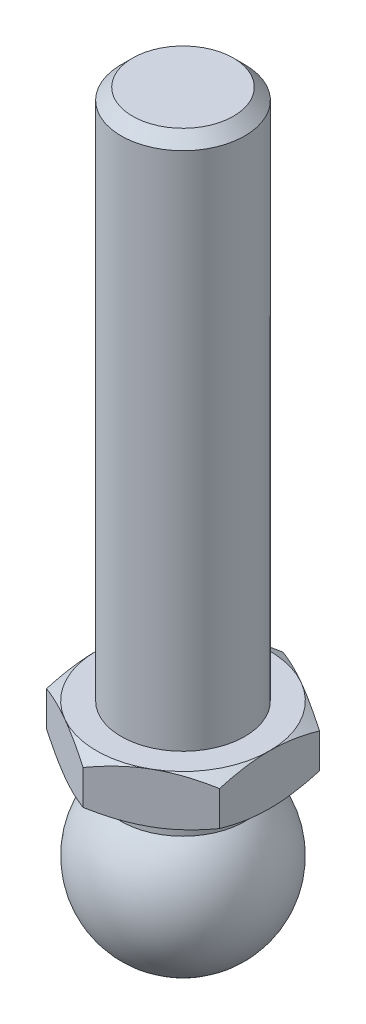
ISO-10303-21;
HEADER;
FILE_DESCRIPTION(('STEP AP214'),'2;1');
FILE_NAME('part.step','',(''),(''),'','','');
FILE_SCHEMA(('AUTOMOTIVE_DESIGN { 1 0 10303 214 1 1 1 1 }'));
ENDSEC;
DATA;
#1=APPLICATION_CONTEXT('core data for automotive mechanical design processes');
#2=APPLICATION_PROTOCOL_DEFINITION('international standard','automotive_design',2000,#1);
#3=PRODUCT_CONTEXT('',#1,'mechanical');
#4=PRODUCT('Part','Part','',(#3));
#5=PRODUCT_RELATED_PRODUCT_CATEGORY('part','',(#4));
#6=PRODUCT_DEFINITION_FORMATION('','',#4);
#7=PRODUCT_DEFINITION_CONTEXT('part definition',#1,'design');
#8=PRODUCT_DEFINITION('design','',#6,#7);
#9=PRODUCT_DEFINITION_SHAPE('','',#8);
#10=(LENGTH_UNIT() NAMED_UNIT(*) SI_UNIT(.MILLI.,.METRE.));
#11=(NAMED_UNIT(*) PLANE_ANGLE_UNIT() SI_UNIT($,.RADIAN.));
#12=(NAMED_UNIT(*) SI_UNIT($,.STERADIAN.) SOLID_ANGLE_UNIT());
#13=UNCERTAINTY_MEASURE_WITH_UNIT(LENGTH_MEASURE(1.E-05),#10,'distance_accuracy_value','');
#14=(GEOMETRIC_REPRESENTATION_CONTEXT(3) GLOBAL_UNCERTAINTY_ASSIGNED_CONTEXT((#13)) GLOBAL_UNIT_ASSIGNED_CONTEXT((#10,
#11,#12)) REPRESENTATION_CONTEXT('',''));
#15=CARTESIAN_POINT('',(0.,0.,0.));
#16=DIRECTION('',(0.,0.,1.));
#17=DIRECTION('',(1.,0.,0.));
#18=AXIS2_PLACEMENT_3D('',#15,#16,#17);
#19=CARTESIAN_POINT('',(0.,10.85,0.));
#20=DIRECTION('',(0.,-1.,0.));
#21=DIRECTION('',(0.,0.,-1.));
#22=AXIS2_PLACEMENT_3D('',#19,#20,#21);
#23=CONICAL_SURFACE('',#22,7.,1.0471975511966);
#24=CARTESIAN_POINT('',(-7.,6.7882826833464,12.1648696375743));
#25=CARTESIAN_POINT('',(-7.,6.93391573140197,11.8738003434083));
#26=CARTESIAN_POINT('',(-7.,7.07854589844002,11.5822239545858));
#27=CARTESIAN_POINT('',(-7.,7.36531569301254,10.997825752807));
#28=CARTESIAN_POINT('',(-7.,7.50745515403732,10.7050038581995));
#29=CARTESIAN_POINT('',(-7.,7.78902214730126,10.117331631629));
#30=CARTESIAN_POINT('',(-7.,7.92844364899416,9.82247840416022));
#31=CARTESIAN_POINT('',(-7.,8.20360604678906,9.23106328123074));
#32=CARTESIAN_POINT('',(-7.,8.33934701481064,8.93450141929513));
#33=CARTESIAN_POINT('',(-7.,8.61231104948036,8.32593520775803));
#34=CARTESIAN_POINT('',(-7.,8.74932547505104,8.01383696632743));
#35=CARTESIAN_POINT('',(-7.,9.01713837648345,7.38695797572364));
#36=CARTESIAN_POINT('',(-7.,9.14793657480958,7.07217710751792));
#37=CARTESIAN_POINT('',(-7.,9.4015530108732,6.4396244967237));
#38=CARTESIAN_POINT('',(-7.,9.52437615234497,6.12185473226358));
#39=CARTESIAN_POINT('',(-7.,9.75990162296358,5.48260317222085));
#40=CARTESIAN_POINT('',(-7.,9.87260505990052,5.16112178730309));
#41=CARTESIAN_POINT('',(-7.,10.1099014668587,4.43821731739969));
#42=CARTESIAN_POINT('',(-7.,10.2311181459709,4.03566892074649));
#43=CARTESIAN_POINT('',(-7.,10.4469740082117,3.22331060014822));
#44=CARTESIAN_POINT('',(-7.,10.5416155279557,2.81350131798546));
#45=CARTESIAN_POINT('',(-7.,10.6569999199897,2.19742561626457));
#46=CARTESIAN_POINT('',(-7.,10.6908518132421,1.99359214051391));
#47=CARTESIAN_POINT('',(-7.,10.7493191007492,1.58461613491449));
#48=CARTESIAN_POINT('',(-7.,10.7739358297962,1.37947379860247));
#49=CARTESIAN_POINT('',(-7.,10.8131968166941,0.96828958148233));
#50=CARTESIAN_POINT('',(-7.,10.8278439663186,0.762247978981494));
#51=CARTESIAN_POINT('',(-7.,10.8467021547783,0.349683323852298));
#52=CARTESIAN_POINT('',(-7.,10.8509132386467,0.143160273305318));
#53=CARTESIAN_POINT('',(-7.,10.8487493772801,-0.271082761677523));
#54=CARTESIAN_POINT('',(-7.,10.8423100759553,-0.478802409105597));
#55=CARTESIAN_POINT('',(-7.,10.8189433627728,-0.893645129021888));
#56=CARTESIAN_POINT('',(-7.,10.8020159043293,-1.10076819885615));
#57=CARTESIAN_POINT('',(-7.,10.7582124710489,-1.514030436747));
#58=CARTESIAN_POINT('',(-7.,10.7313327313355,-1.72016920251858));
#59=CARTESIAN_POINT('',(-7.,10.6684180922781,-2.13103319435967));
#60=CARTESIAN_POINT('',(-7.,10.6323828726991,-2.33575837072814));
#61=CARTESIAN_POINT('',(-7.,10.5105686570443,-2.95437912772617));
#62=CARTESIAN_POINT('',(-7.,10.4118729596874,-3.36575077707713));
#63=CARTESIAN_POINT('',(-7.,10.1884533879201,-4.18138012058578));
#64=CARTESIAN_POINT('',(-7.,10.0637148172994,-4.58563365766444));
#65=CARTESIAN_POINT('',(-7.,9.82332483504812,-5.30320893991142));
#66=CARTESIAN_POINT('',(-7.,9.71128759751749,-5.617759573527));
#67=CARTESIAN_POINT('',(-7.,9.47785144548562,-6.24325021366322));
#68=CARTESIAN_POINT('',(-7.,9.35645511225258,-6.55419118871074));
#69=CARTESIAN_POINT('',(-7.,9.10620704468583,-7.17328528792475));
#70=CARTESIAN_POINT('',(-7.,8.97735033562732,-7.48143638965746));
#71=CARTESIAN_POINT('',(-7.,8.71378231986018,-8.09523802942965));
#72=CARTESIAN_POINT('',(-7.,8.57907065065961,-8.40088841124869));
#73=CARTESIAN_POINT('',(-7.,8.31078407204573,-8.99716345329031));
#74=CARTESIAN_POINT('',(-7.,8.17740317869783,-9.28787568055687));
#75=CARTESIAN_POINT('',(-7.,7.90714715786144,-9.86766295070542));
#76=CARTESIAN_POINT('',(-7.,7.77027208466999,-10.1567380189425));
#77=CARTESIAN_POINT('',(-7.,7.49389786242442,-10.7329937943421));
#78=CARTESIAN_POINT('',(-7.,7.35440383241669,-11.0201769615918));
#79=CARTESIAN_POINT('',(-7.,7.07302286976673,-11.5933594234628));
#80=CARTESIAN_POINT('',(-7.,6.93113600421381,-11.879358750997));
#81=CARTESIAN_POINT('',(-7.,6.7882826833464,-12.1648696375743));
#82=B_SPLINE_CURVE_WITH_KNOTS('',3,(#24,#25,#26,#27,#28,#29,#30,#31,#32,#33,#34,#35,#36,#37,#38,
#39,#40,#41,#42,#43,#44,#45,#46,#47,#48,#49,#50,#51,#52,#53,#54,#55,#56,#57,#58,#59,#60,#61,#62,
#63,#64,#65,#66,#67,#68,#69,#70,#71,#72,#73,#74,#75,#76,#77,#78,#79,#80,#81),.UNSPECIFIED.,.F.,
.F.,(4,2,2,2,2,2,2,2,2,2,2,2,2,2,2,2,2,2,2,2,2,2,2,2,2,2,2,2,4),(0.,0.976413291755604,
1.95289161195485,2.93133423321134,3.90975772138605,4.93225217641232,5.95479223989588,
6.97669748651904,7.99849072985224,9.25906449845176,10.5195273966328,11.1392271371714,
11.7588372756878,12.3782676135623,12.9976952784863,13.6208795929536,14.2440666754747,
14.8674897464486,15.4909346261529,16.7587972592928,18.0273773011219,19.0289263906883,
20.0302002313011,21.0321496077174,22.0341611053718,22.9936838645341,23.9531917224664,
24.9109871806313,25.8687558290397),.UNSPECIFIED.);
#83=CARTESIAN_POINT('',(-7.,10.2247852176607,4.04145188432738));
#84=VERTEX_POINT('',#83);
#85=CARTESIAN_POINT('',(-7.,10.85,0.));
#86=VERTEX_POINT('',#85);
#87=EDGE_CURVE('E309',#84,#86,#82,.T.);
#88=ORIENTED_EDGE('',*,*,#87,.F.);
#89=CARTESIAN_POINT('',(0.00020000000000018,10.2247185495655,8.0830192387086));
#90=CARTESIAN_POINT('',(-0.153667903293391,10.2760001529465,7.99418356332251));
#91=CARTESIAN_POINT('',(-0.30810950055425,10.3249544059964,7.90501666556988));
#92=CARTESIAN_POINT('',(-0.618246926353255,10.4175672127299,7.72595873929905));
#93=CARTESIAN_POINT('',(-0.773943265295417,10.4612234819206,7.63606741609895));
#94=CARTESIAN_POINT('',(-1.24352516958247,10.5833884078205,7.36495417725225));
#95=CARTESIAN_POINT('',(-1.5592643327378,10.652874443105,7.18266208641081));
#96=CARTESIAN_POINT('',(-2.03176224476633,10.7343550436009,6.9098652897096));
#97=CARTESIAN_POINT('',(-2.18710922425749,10.7575665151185,6.82017566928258));
#98=CARTESIAN_POINT('',(-2.49850511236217,10.7964887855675,6.64039116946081));
#99=CARTESIAN_POINT('',(-2.65455395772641,10.8122002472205,6.55029632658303));
#100=CARTESIAN_POINT('',(-2.96692267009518,10.8357220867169,6.3699501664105));
#101=CARTESIAN_POINT('',(-3.12324202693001,10.8435414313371,6.27969914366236));
#102=CARTESIAN_POINT('',(-3.43601650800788,10.8511197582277,6.09911871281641));
#103=CARTESIAN_POINT('',(-3.59247162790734,10.850878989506,6.00878930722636));
#104=CARTESIAN_POINT('',(-4.02110687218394,10.8391402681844,5.76131663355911));
#105=CARTESIAN_POINT('',(-4.2931466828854,10.8194342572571,5.60425437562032));
#106=CARTESIAN_POINT('',(-4.8354194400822,10.7569465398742,5.29117305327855));
#107=CARTESIAN_POINT('',(-5.10565047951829,10.714143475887,5.13515508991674));
#108=CARTESIAN_POINT('',(-5.64901454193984,10.6071483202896,4.82144370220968));
#109=CARTESIAN_POINT('',(-5.92207900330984,10.5425029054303,4.66378986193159));
#110=CARTESIAN_POINT('',(-6.46413578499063,10.395783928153,4.35083323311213));
#111=CARTESIAN_POINT('',(-6.73313504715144,10.3137448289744,4.19552643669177));
#112=CARTESIAN_POINT('',(-7.0002,10.2247185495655,4.04133641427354));
#113=B_SPLINE_CURVE_WITH_KNOTS('',3,(#89,#90,#91,#92,#93,#94,#95,#96,#97,#98,#99,#100,#101,#102,
#103,#104,#105,#106,#107,#108,#109,#110,#111,#112),.UNSPECIFIED.,.F.,.F.,(4,2,2,2,2,2,2,2,2,2,2,
4),(0.,0.554727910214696,1.10969417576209,2.2219327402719,2.76443041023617,3.30688013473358,
3.84871284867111,4.3905288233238,5.33376515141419,6.27787517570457,7.2429241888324,
8.20607866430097),.UNSPECIFIED.);
#114=CARTESIAN_POINT('',(-3.5,10.85,6.06217782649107));
#115=VERTEX_POINT('',#114);
#116=EDGE_CURVE('E135',#115,#84,#113,.T.);
#117=ORIENTED_EDGE('',*,*,#116,.F.);
#118=CARTESIAN_POINT('',(0.,10.85,0.));
#119=DIRECTION('',(0.,-1.,0.));
#120=DIRECTION('',(0.,0.,-1.));
#121=AXIS2_PLACEMENT_3D('',#118,#119,#120);
#122=CIRCLE('',#121,7.);
#123=EDGE_CURVE('E283',#115,#86,#122,.T.);
#124=ORIENTED_EDGE('',*,*,#123,.T.);
#125=EDGE_LOOP('',(#88,#117,#124));
#126=FACE_BOUND('',#125,.T.);
#127=ADVANCED_FACE('F14',(#126),#23,.T.);
#128=CARTESIAN_POINT('',(-7.,10.2247852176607,-4.04145188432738));
#129=VERTEX_POINT('',#128);
#130=EDGE_CURVE('E193',#86,#129,#82,.T.);
#131=ORIENTED_EDGE('',*,*,#130,.F.);
#132=CARTESIAN_POINT('',(-3.5,10.85,-6.06217782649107));
#133=VERTEX_POINT('',#132);
#134=EDGE_CURVE('E195',#86,#133,#122,.T.);
#135=ORIENTED_EDGE('',*,*,#134,.T.);
#136=CARTESIAN_POINT('',(-7.0002,10.2247185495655,-4.04133641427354));
#137=CARTESIAN_POINT('',(-6.84633209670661,10.2760001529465,-4.13017208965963));
#138=CARTESIAN_POINT('',(-6.69189049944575,10.3249544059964,-4.21933898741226));
#139=CARTESIAN_POINT('',(-6.38175307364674,10.4175672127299,-4.39839691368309));
#140=CARTESIAN_POINT('',(-6.22605673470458,10.4612234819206,-4.48828823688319));
#141=CARTESIAN_POINT('',(-5.75647483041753,10.5833884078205,-4.75940147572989));
#142=CARTESIAN_POINT('',(-5.44073566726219,10.652874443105,-4.94169356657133));
#143=CARTESIAN_POINT('',(-4.96823775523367,10.7343550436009,-5.21449036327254));
#144=CARTESIAN_POINT('',(-4.81289077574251,10.7575665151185,-5.30417998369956));
#145=CARTESIAN_POINT('',(-4.50149488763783,10.7964887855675,-5.48396448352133));
#146=CARTESIAN_POINT('',(-4.34544604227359,10.8122002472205,-5.57405932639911));
#147=CARTESIAN_POINT('',(-4.03307732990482,10.8357220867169,-5.75440548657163));
#148=CARTESIAN_POINT('',(-3.87675797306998,10.8435414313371,-5.84465650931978));
#149=CARTESIAN_POINT('',(-3.56398349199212,10.8511197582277,-6.02523694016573));
#150=CARTESIAN_POINT('',(-3.40752837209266,10.850878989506,-6.11556634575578));
#151=CARTESIAN_POINT('',(-2.97889312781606,10.8391402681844,-6.36303901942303));
#152=CARTESIAN_POINT('',(-2.70685331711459,10.8194342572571,-6.52010127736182));
#153=CARTESIAN_POINT('',(-2.1645805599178,10.7569465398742,-6.83318259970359));
#154=CARTESIAN_POINT('',(-1.89434952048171,10.714143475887,-6.9892005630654));
#155=CARTESIAN_POINT('',(-1.35098545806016,10.6071483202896,-7.30291195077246));
#156=CARTESIAN_POINT('',(-1.07792099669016,10.5425029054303,-7.46056579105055));
#157=CARTESIAN_POINT('',(-0.535864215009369,10.395783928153,-7.77352241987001));
#158=CARTESIAN_POINT('',(-0.266864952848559,10.3137448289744,-7.92882921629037));
#159=CARTESIAN_POINT('',(0.000200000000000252,10.2247185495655,-8.0830192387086));
#160=B_SPLINE_CURVE_WITH_KNOTS('',3,(#136,#137,#138,#139,#140,#141,#142,#143,#144,#145,#146,
#147,#148,#149,#150,#151,#152,#153,#154,#155,#156,#157,#158,#159),.UNSPECIFIED.,.F.,.F.,(4,2,2,
2,2,2,2,2,2,2,2,4),(0.,0.554727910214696,1.10969417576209,2.2219327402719,2.76443041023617,
3.30688013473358,3.8487128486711,4.3905288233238,5.33376515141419,6.27787517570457,
7.2429241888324,8.20607866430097),.UNSPECIFIED.);
#161=EDGE_CURVE('E183',#129,#133,#160,.T.);
#162=ORIENTED_EDGE('',*,*,#161,.F.);
#163=EDGE_LOOP('',(#131,#135,#162));
#164=FACE_BOUND('',#163,.T.);
#165=ADVANCED_FACE('F192',(#164),#23,.T.);
#166=CARTESIAN_POINT('',(0.,10.2247852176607,-8.08290376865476));
#167=VERTEX_POINT('',#166);
#168=EDGE_CURVE('E197',#133,#167,#160,.T.);
#169=ORIENTED_EDGE('',*,*,#168,.F.);
#170=CARTESIAN_POINT('',(3.5,10.85,-6.06217782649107));
#171=VERTEX_POINT('',#170);
#172=EDGE_CURVE('E293',#133,#171,#122,.T.);
#173=ORIENTED_EDGE('',*,*,#172,.T.);
#174=CARTESIAN_POINT('',(-0.00020000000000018,10.2247185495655,-8.0830192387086));
#175=CARTESIAN_POINT('',(0.153667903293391,10.2760001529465,-7.99418356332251));
#176=CARTESIAN_POINT('',(0.30810950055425,10.3249544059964,-7.90501666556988));
#177=CARTESIAN_POINT('',(0.618246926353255,10.4175672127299,-7.72595873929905));
#178=CARTESIAN_POINT('',(0.773943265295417,10.4612234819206,-7.63606741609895));
#179=CARTESIAN_POINT('',(1.24352516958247,10.5833884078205,-7.36495417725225));
#180=CARTESIAN_POINT('',(1.5592643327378,10.652874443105,-7.18266208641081));
#181=CARTESIAN_POINT('',(2.03176224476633,10.7343550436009,-6.9098652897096));
#182=CARTESIAN_POINT('',(2.18710922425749,10.7575665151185,-6.82017566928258));
#183=CARTESIAN_POINT('',(2.49850511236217,10.7964887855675,-6.64039116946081));
#184=CARTESIAN_POINT('',(2.65455395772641,10.8122002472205,-6.55029632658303));
#185=CARTESIAN_POINT('',(2.96692267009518,10.8357220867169,-6.3699501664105));
#186=CARTESIAN_POINT('',(3.12324202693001,10.8435414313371,-6.27969914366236));
#187=CARTESIAN_POINT('',(3.43601650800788,10.8511197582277,-6.09911871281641));
#188=CARTESIAN_POINT('',(3.59247162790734,10.850878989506,-6.00878930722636));
#189=CARTESIAN_POINT('',(4.02110687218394,10.8391402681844,-5.76131663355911));
#190=CARTESIAN_POINT('',(4.2931466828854,10.8194342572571,-5.60425437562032));
#191=CARTESIAN_POINT('',(4.8354194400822,10.7569465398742,-5.29117305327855));
#192=CARTESIAN_POINT('',(5.10565047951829,10.714143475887,-5.13515508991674));
#193=CARTESIAN_POINT('',(5.64901454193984,10.6071483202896,-4.82144370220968));
#194=CARTESIAN_POINT('',(5.92207900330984,10.5425029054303,-4.66378986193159));
#195=CARTESIAN_POINT('',(6.46413578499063,10.395783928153,-4.35083323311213));
#196=CARTESIAN_POINT('',(6.73313504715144,10.3137448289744,-4.19552643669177));
#197=CARTESIAN_POINT('',(7.0002,10.2247185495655,-4.04133641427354));
#198=B_SPLINE_CURVE_WITH_KNOTS('',3,(#174,#175,#176,#177,#178,#179,#180,#181,#182,#183,#184,
#185,#186,#187,#188,#189,#190,#191,#192,#193,#194,#195,#196,#197),.UNSPECIFIED.,.F.,.F.,(4,2,2,
2,2,2,2,2,2,2,2,4),(0.,0.554727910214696,1.10969417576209,2.2219327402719,2.76443041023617,
3.30688013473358,3.84871284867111,4.3905288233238,5.33376515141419,6.27787517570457,
7.2429241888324,8.20607866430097),.UNSPECIFIED.);
#199=EDGE_CURVE('E243',#167,#171,#198,.T.);
#200=ORIENTED_EDGE('',*,*,#199,.F.);
#201=EDGE_LOOP('',(#169,#173,#200));
#202=FACE_BOUND('',#201,.T.);
#203=ADVANCED_FACE('F342',(#202),#23,.T.);
#204=CARTESIAN_POINT('',(7.,10.2247852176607,-4.04145188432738));
#205=VERTEX_POINT('',#204);
#206=EDGE_CURVE('E238',#171,#205,#198,.T.);
#207=ORIENTED_EDGE('',*,*,#206,.F.);
#208=CARTESIAN_POINT('',(7.,10.85,0.));
#209=VERTEX_POINT('',#208);
#210=EDGE_CURVE('E288',#171,#209,#122,.T.);
#211=ORIENTED_EDGE('',*,*,#210,.T.);
#212=CARTESIAN_POINT('',(7.,6.7882826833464,-12.1648696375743));
#213=CARTESIAN_POINT('',(7.,6.93391573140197,-11.8738003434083));
#214=CARTESIAN_POINT('',(7.,7.07854589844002,-11.5822239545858));
#215=CARTESIAN_POINT('',(7.,7.36531569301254,-10.997825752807));
#216=CARTESIAN_POINT('',(7.,7.50745515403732,-10.7050038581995));
#217=CARTESIAN_POINT('',(7.,7.78902214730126,-10.117331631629));
#218=CARTESIAN_POINT('',(7.,7.92844364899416,-9.82247840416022));
#219=CARTESIAN_POINT('',(7.,8.20360604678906,-9.23106328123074));
#220=CARTESIAN_POINT('',(7.,8.33934701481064,-8.93450141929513));
#221=CARTESIAN_POINT('',(7.,8.61231104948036,-8.32593520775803));
#222=CARTESIAN_POINT('',(7.,8.74932547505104,-8.01383696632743));
#223=CARTESIAN_POINT('',(7.,9.01713837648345,-7.38695797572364));
#224=CARTESIAN_POINT('',(7.,9.14793657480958,-7.07217710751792));
#225=CARTESIAN_POINT('',(7.,9.4015530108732,-6.4396244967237));
#226=CARTESIAN_POINT('',(7.,9.52437615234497,-6.12185473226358));
#227=CARTESIAN_POINT('',(7.,9.75990162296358,-5.48260317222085));
#228=CARTESIAN_POINT('',(7.,9.87260505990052,-5.16112178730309));
#229=CARTESIAN_POINT('',(7.,10.1099014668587,-4.43821731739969));
#230=CARTESIAN_POINT('',(7.,10.2311181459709,-4.03566892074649));
#231=CARTESIAN_POINT('',(7.,10.4469740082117,-3.22331060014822));
#232=CARTESIAN_POINT('',(7.,10.5416155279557,-2.81350131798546));
#233=CARTESIAN_POINT('',(7.,10.6569999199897,-2.19742561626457));
#234=CARTESIAN_POINT('',(7.,10.6908518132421,-1.99359214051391));
#235=CARTESIAN_POINT('',(7.,10.7493191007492,-1.58461613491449));
#236=CARTESIAN_POINT('',(7.,10.7739358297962,-1.37947379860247));
#237=CARTESIAN_POINT('',(7.,10.8131968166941,-0.96828958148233));
#238=CARTESIAN_POINT('',(7.,10.8278439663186,-0.762247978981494));
#239=CARTESIAN_POINT('',(7.,10.8467021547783,-0.349683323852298));
#240=CARTESIAN_POINT('',(7.,10.8509132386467,-0.143160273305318));
#241=CARTESIAN_POINT('',(7.,10.8487493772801,0.271082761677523));
#242=CARTESIAN_POINT('',(7.,10.8423100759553,0.478802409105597));
#243=CARTESIAN_POINT('',(7.,10.8189433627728,0.893645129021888));
#244=CARTESIAN_POINT('',(7.,10.8020159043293,1.10076819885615));
#245=CARTESIAN_POINT('',(7.,10.7582124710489,1.514030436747));
#246=CARTESIAN_POINT('',(7.,10.7313327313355,1.72016920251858));
#247=CARTESIAN_POINT('',(7.,10.6684180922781,2.13103319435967));
#248=CARTESIAN_POINT('',(7.,10.6323828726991,2.33575837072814));
#249=CARTESIAN_POINT('',(7.,10.5105686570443,2.95437912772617));
#250=CARTESIAN_POINT('',(7.,10.4118729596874,3.36575077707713));
#251=CARTESIAN_POINT('',(7.,10.1884533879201,4.18138012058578));
#252=CARTESIAN_POINT('',(7.,10.0637148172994,4.58563365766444));
#253=CARTESIAN_POINT('',(7.,9.82332483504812,5.30320893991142));
#254=CARTESIAN_POINT('',(7.,9.71128759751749,5.617759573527));
#255=CARTESIAN_POINT('',(7.,9.47785144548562,6.24325021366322));
#256=CARTESIAN_POINT('',(7.,9.35645511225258,6.55419118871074));
#257=CARTESIAN_POINT('',(7.,9.10620704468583,7.17328528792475));
#258=CARTESIAN_POINT('',(7.,8.97735033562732,7.48143638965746));
#259=CARTESIAN_POINT('',(7.,8.71378231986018,8.09523802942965));
#260=CARTESIAN_POINT('',(7.,8.57907065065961,8.40088841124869));
#261=CARTESIAN_POINT('',(7.,8.31078407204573,8.99716345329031));
#262=CARTESIAN_POINT('',(7.,8.17740317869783,9.28787568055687));
#263=CARTESIAN_POINT('',(7.,7.90714715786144,9.86766295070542));
#264=CARTESIAN_POINT('',(7.,7.77027208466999,10.1567380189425));
#265=CARTESIAN_POINT('',(7.,7.49389786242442,10.7329937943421));
#266=CARTESIAN_POINT('',(7.,7.35440383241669,11.0201769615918));
#267=CARTESIAN_POINT('',(7.,7.07302286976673,11.5933594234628));
#268=CARTESIAN_POINT('',(7.,6.93113600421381,11.879358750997));
#269=CARTESIAN_POINT('',(7.,6.7882826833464,12.1648696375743));
#270=B_SPLINE_CURVE_WITH_KNOTS('',3,(#212,#213,#214,#215,#216,#217,#218,#219,#220,#221,#222,
#223,#224,#225,#226,#227,#228,#229,#230,#231,#232,#233,#234,#235,#236,#237,#238,#239,#240,#241,
#242,#243,#244,#245,#246,#247,#248,#249,#250,#251,#252,#253,#254,#255,#256,#257,#258,#259,#260,
#261,#262,#263,#264,#265,#266,#267,#268,#269),.UNSPECIFIED.,.F.,.F.,(4,2,2,2,2,2,2,2,2,2,2,2,2,
2,2,2,2,2,2,2,2,2,2,2,2,2,2,2,4),(0.,0.976413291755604,1.95289161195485,2.93133423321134,
3.90975772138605,4.93225217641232,5.95479223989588,6.97669748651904,7.99849072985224,
9.25906449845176,10.5195273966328,11.1392271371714,11.7588372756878,12.3782676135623,
12.9976952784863,13.6208795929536,14.2440666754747,14.8674897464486,15.4909346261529,
16.7587972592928,18.0273773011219,19.0289263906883,20.0302002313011,21.0321496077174,
22.0341611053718,22.9936838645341,23.9531917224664,24.9109871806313,25.8687558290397),.UNSPECIFIED.);
#271=EDGE_CURVE('E249',#205,#209,#270,.T.);
#272=ORIENTED_EDGE('',*,*,#271,.F.);
#273=EDGE_LOOP('',(#207,#211,#272));
#274=FACE_BOUND('',#273,.T.);
#275=ADVANCED_FACE('F352',(#274),#23,.T.);
#276=CARTESIAN_POINT('',(7.,10.2247852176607,4.04145188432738));
#277=VERTEX_POINT('',#276);
#278=EDGE_CURVE('E251',#209,#277,#270,.T.);
#279=ORIENTED_EDGE('',*,*,#278,.F.);
#280=CARTESIAN_POINT('',(3.5,10.85,6.06217782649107));
#281=VERTEX_POINT('',#280);
#282=EDGE_CURVE('E281',#209,#281,#122,.T.);
#283=ORIENTED_EDGE('',*,*,#282,.T.);
#284=CARTESIAN_POINT('',(7.0002,10.2247185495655,4.04133641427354));
#285=CARTESIAN_POINT('',(6.84633209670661,10.2760001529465,4.13017208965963));
#286=CARTESIAN_POINT('',(6.69189049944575,10.3249544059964,4.21933898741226));
#287=CARTESIAN_POINT('',(6.38175307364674,10.4175672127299,4.39839691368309));
#288=CARTESIAN_POINT('',(6.22605673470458,10.4612234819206,4.48828823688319));
#289=CARTESIAN_POINT('',(5.75647483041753,10.5833884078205,4.75940147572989));
#290=CARTESIAN_POINT('',(5.44073566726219,10.652874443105,4.94169356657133));
#291=CARTESIAN_POINT('',(4.96823775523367,10.7343550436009,5.21449036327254));
#292=CARTESIAN_POINT('',(4.81289077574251,10.7575665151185,5.30417998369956));
#293=CARTESIAN_POINT('',(4.50149488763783,10.7964887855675,5.48396448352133));
#294=CARTESIAN_POINT('',(4.34544604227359,10.8122002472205,5.57405932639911));
#295=CARTESIAN_POINT('',(4.03307732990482,10.8357220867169,5.75440548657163));
#296=CARTESIAN_POINT('',(3.87675797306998,10.8435414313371,5.84465650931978));
#297=CARTESIAN_POINT('',(3.56398349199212,10.8511197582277,6.02523694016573));
#298=CARTESIAN_POINT('',(3.40752837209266,10.850878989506,6.11556634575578));
#299=CARTESIAN_POINT('',(2.97889312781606,10.8391402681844,6.36303901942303));
#300=CARTESIAN_POINT('',(2.70685331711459,10.8194342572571,6.52010127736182));
#301=CARTESIAN_POINT('',(2.1645805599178,10.7569465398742,6.83318259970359));
#302=CARTESIAN_POINT('',(1.89434952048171,10.714143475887,6.9892005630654));
#303=CARTESIAN_POINT('',(1.35098545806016,10.6071483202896,7.30291195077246));
#304=CARTESIAN_POINT('',(1.07792099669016,10.5425029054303,7.46056579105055));
#305=CARTESIAN_POINT('',(0.535864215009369,10.395783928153,7.77352241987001));
#306=CARTESIAN_POINT('',(0.266864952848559,10.3137448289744,7.92882921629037));
#307=CARTESIAN_POINT('',(-0.000200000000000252,10.2247185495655,8.0830192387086));
#308=B_SPLINE_CURVE_WITH_KNOTS('',3,(#284,#285,#286,#287,#288,#289,#290,#291,#292,#293,#294,
#295,#296,#297,#298,#299,#300,#301,#302,#303,#304,#305,#306,#307),.UNSPECIFIED.,.F.,.F.,(4,2,2,
2,2,2,2,2,2,2,2,4),(0.,0.554727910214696,1.10969417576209,2.2219327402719,2.76443041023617,
3.30688013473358,3.8487128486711,4.3905288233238,5.33376515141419,6.27787517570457,
7.2429241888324,8.20607866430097),.UNSPECIFIED.);
#309=EDGE_CURVE('E126',#277,#281,#308,.T.);
#310=ORIENTED_EDGE('',*,*,#309,.F.);
#311=EDGE_LOOP('',(#279,#283,#310));
#312=FACE_BOUND('',#311,.T.);
#313=ADVANCED_FACE('F285',(#312),#23,.T.);
#314=CARTESIAN_POINT('',(0.,10.2247852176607,8.08290376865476));
#315=VERTEX_POINT('',#314);
#316=EDGE_CURVE('E116',#281,#315,#308,.T.);
#317=ORIENTED_EDGE('',*,*,#316,.F.);
#318=EDGE_CURVE('E274',#281,#115,#122,.T.);
#319=ORIENTED_EDGE('',*,*,#318,.T.);
#320=EDGE_CURVE('E29',#315,#115,#113,.T.);
#321=ORIENTED_EDGE('',*,*,#320,.F.);
#322=EDGE_LOOP('',(#317,#319,#321));
#323=FACE_BOUND('',#322,.T.);
#324=ADVANCED_FACE('F273',(#323),#23,.T.);
#325=CARTESIAN_POINT('',(0.,53.85,0.));
#326=DIRECTION('',(0.,-1.,0.));
#327=DIRECTION('',(0.,0.,-1.));
#328=AXIS2_PLACEMENT_3D('',#325,#326,#327);
#329=PLANE('',#328);
#330=CARTESIAN_POINT('',(0.,53.85,0.));
#331=DIRECTION('',(0.,-1.,0.));
#332=DIRECTION('',(0.,0.,-1.));
#333=AXIS2_PLACEMENT_3D('',#330,#331,#332);
#334=CIRCLE('',#333,4.08);
#335=CARTESIAN_POINT('',(0.,53.85,-4.08));
#336=VERTEX_POINT('',#335);
#337=EDGE_CURVE('E22',#336,#336,#334,.T.);
#338=ORIENTED_EDGE('',*,*,#337,.F.);
#339=EDGE_LOOP('',(#338));
#340=FACE_BOUND('',#339,.T.);
#341=ADVANCED_FACE('F16',(#340),#329,.F.);
#342=CARTESIAN_POINT('',(0.,53.85,0.));
#343=DIRECTION('',(0.,-1.,0.));
#344=DIRECTION('',(0.,0.,-1.));
#345=AXIS2_PLACEMENT_3D('',#342,#343,#344);
#346=CONICAL_SURFACE('',#345,4.08,0.785398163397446);
#347=CARTESIAN_POINT('',(0.,52.93,0.));
#348=DIRECTION('',(0.,-1.,0.));
#349=DIRECTION('',(0.,0.,-1.));
#350=AXIS2_PLACEMENT_3D('',#347,#348,#349);
#351=CIRCLE('',#350,5.);
#352=CARTESIAN_POINT('',(0.,52.93,-5.));
#353=VERTEX_POINT('',#352);
#354=EDGE_CURVE('E290',#353,#353,#351,.T.);
#355=ORIENTED_EDGE('',*,*,#354,.F.);
#356=EDGE_LOOP('',(#355));
#357=FACE_BOUND('',#356,.T.);
#358=ORIENTED_EDGE('',*,*,#337,.T.);
#359=EDGE_LOOP('',(#358));
#360=FACE_BOUND('',#359,.T.);
#361=ADVANCED_FACE('F350',(#357,#360),#346,.T.);
#362=CARTESIAN_POINT('',(0.,-7.,0.));
#363=DIRECTION('',(0.,-1.,0.));
#364=DIRECTION('',(0.,0.,-1.));
#365=AXIS2_PLACEMENT_3D('',#362,#363,#364);
#366=CYLINDRICAL_SURFACE('',#365,5.);
#367=CARTESIAN_POINT('',(0.,10.85,0.));
#368=DIRECTION('',(0.,-1.,0.));
#369=DIRECTION('',(0.,0.,-1.));
#370=AXIS2_PLACEMENT_3D('',#367,#368,#369);
#371=CIRCLE('',#370,5.);
#372=CARTESIAN_POINT('',(0.,10.85,-5.));
#373=VERTEX_POINT('',#372);
#374=EDGE_CURVE('E287',#373,#373,#371,.T.);
#375=ORIENTED_EDGE('',*,*,#374,.F.);
#376=EDGE_LOOP('',(#375));
#377=FACE_BOUND('',#376,.T.);
#378=ORIENTED_EDGE('',*,*,#354,.T.);
#379=EDGE_LOOP('',(#378));
#380=FACE_BOUND('',#379,.T.);
#381=ADVANCED_FACE('F427',(#377,#380),#366,.T.);
#382=CARTESIAN_POINT('',(5.,10.85,0.));
#383=DIRECTION('',(0.,-1.,0.));
#384=DIRECTION('',(0.,0.,-1.));
#385=AXIS2_PLACEMENT_3D('',#382,#383,#384);
#386=PLANE('',#385);
#387=ORIENTED_EDGE('',*,*,#282,.F.);
#388=ORIENTED_EDGE('',*,*,#210,.F.);
#389=ORIENTED_EDGE('',*,*,#172,.F.);
#390=ORIENTED_EDGE('',*,*,#134,.F.);
#391=ORIENTED_EDGE('',*,*,#123,.F.);
#392=ORIENTED_EDGE('',*,*,#318,.F.);
#393=EDGE_LOOP('',(#387,#388,#389,#390,#391,#392));
#394=FACE_BOUND('',#393,.T.);
#395=ORIENTED_EDGE('',*,*,#374,.T.);
#396=EDGE_LOOP('',(#395));
#397=FACE_BOUND('',#396,.T.);
#398=ADVANCED_FACE('F278',(#394,#397),#386,.F.);
#399=CARTESIAN_POINT('',(-7.,6.8,-4.04145188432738));
#400=DIRECTION('',(-1.,0.,0.));
#401=DIRECTION('',(0.,0.,1.));
#402=AXIS2_PLACEMENT_3D('',#399,#400,#401);
#403=PLANE('',#402);
#404=ORIENTED_EDGE('',*,*,#87,.T.);
#405=ORIENTED_EDGE('',*,*,#130,.T.);
#406=DIRECTION('',(0.,1.,0.));
#407=VECTOR('',#406,1.);
#408=CARTESIAN_POINT('',(-7.,6.8,-4.04145188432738));
#409=LINE('',#408,#407);
#410=CARTESIAN_POINT('',(-7.,7.42521478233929,-4.04145188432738));
#411=VERTEX_POINT('',#410);
#412=EDGE_CURVE('E109',#411,#129,#409,.T.);
#413=ORIENTED_EDGE('',*,*,#412,.F.);
#414=CARTESIAN_POINT('',(-7.,10.8617173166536,-12.1648696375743));
#415=CARTESIAN_POINT('',(-7.,10.716084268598,-11.8738003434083));
#416=CARTESIAN_POINT('',(-7.,10.57145410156,-11.5822239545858));
#417=CARTESIAN_POINT('',(-7.,10.2846843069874,-10.997825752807));
#418=CARTESIAN_POINT('',(-7.,10.1425448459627,-10.7050038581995));
#419=CARTESIAN_POINT('',(-7.,9.86097785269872,-10.1173316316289));
#420=CARTESIAN_POINT('',(-7.,9.72155635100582,-9.82247840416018));
#421=CARTESIAN_POINT('',(-7.,9.44639395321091,-9.23106328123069));
#422=CARTESIAN_POINT('',(-7.,9.31065298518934,-8.93450141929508));
#423=CARTESIAN_POINT('',(-7.,9.03768895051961,-8.32593520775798));
#424=CARTESIAN_POINT('',(-7.,8.90067452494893,-8.01383696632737));
#425=CARTESIAN_POINT('',(-7.,8.63286162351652,-7.38695797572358));
#426=CARTESIAN_POINT('',(-7.,8.50206342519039,-7.07217710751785));
#427=CARTESIAN_POINT('',(-7.,8.24844698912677,-6.43962449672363));
#428=CARTESIAN_POINT('',(-7.,8.125623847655,-6.12185473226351));
#429=CARTESIAN_POINT('',(-7.,7.8900983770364,-5.48260317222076));
#430=CARTESIAN_POINT('',(-7.,7.77739494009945,-5.16112178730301));
#431=CARTESIAN_POINT('',(-7.,7.54009853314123,-4.4382173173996));
#432=CARTESIAN_POINT('',(-7.,7.41888185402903,-4.03566892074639));
#433=CARTESIAN_POINT('',(-7.,7.20302599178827,-3.22331060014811));
#434=CARTESIAN_POINT('',(-7.,7.10838447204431,-2.81350131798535));
#435=CARTESIAN_POINT('',(-7.,6.99300008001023,-2.19742561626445));
#436=CARTESIAN_POINT('',(-7.,6.95914818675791,-1.99359214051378));
#437=CARTESIAN_POINT('',(-7.,6.90068089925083,-1.58461613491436));
#438=CARTESIAN_POINT('',(-7.,6.8760641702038,-1.37947379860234));
#439=CARTESIAN_POINT('',(-7.,6.83680318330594,-0.968289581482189));
#440=CARTESIAN_POINT('',(-7.,6.82215603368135,-0.76224797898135));
#441=CARTESIAN_POINT('',(-7.,6.80329784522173,-0.349683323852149));
#442=CARTESIAN_POINT('',(-7.,6.79908676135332,-0.143160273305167));
#443=CARTESIAN_POINT('',(-7.,6.80125062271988,0.271082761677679));
#444=CARTESIAN_POINT('',(-7.,6.80768992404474,0.478802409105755));
#445=CARTESIAN_POINT('',(-7.,6.83105663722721,0.893645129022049));
#446=CARTESIAN_POINT('',(-7.,6.84798409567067,1.10076819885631));
#447=CARTESIAN_POINT('',(-7.,6.89178752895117,1.51403043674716));
#448=CARTESIAN_POINT('',(-7.,6.91866726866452,1.72016920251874));
#449=CARTESIAN_POINT('',(-7.,6.98158190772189,2.13103319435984));
#450=CARTESIAN_POINT('',(-7.,7.01761712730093,2.33575837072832));
#451=CARTESIAN_POINT('',(-7.,7.13943134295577,2.95437912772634));
#452=CARTESIAN_POINT('',(-7.,7.23812704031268,3.3657507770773));
#453=CARTESIAN_POINT('',(-7.,7.46154661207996,4.18138012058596));
#454=CARTESIAN_POINT('',(-7.,7.58628518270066,4.58563365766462));
#455=CARTESIAN_POINT('',(-7.,7.82667516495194,5.3032089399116));
#456=CARTESIAN_POINT('',(-7.,7.93871240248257,5.61775957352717));
#457=CARTESIAN_POINT('',(-7.,8.17214855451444,6.24325021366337));
#458=CARTESIAN_POINT('',(-7.,8.29354488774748,6.55419118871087));
#459=CARTESIAN_POINT('',(-7.,8.54379295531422,7.17328528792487));
#460=CARTESIAN_POINT('',(-7.,8.67264966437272,7.48143638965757));
#461=CARTESIAN_POINT('',(-7.,8.93621768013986,8.09523802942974));
#462=CARTESIAN_POINT('',(-7.,9.07092934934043,8.40088841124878));
#463=CARTESIAN_POINT('',(-7.,9.33921592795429,8.99716345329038));
#464=CARTESIAN_POINT('',(-7.,9.47259682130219,9.28787568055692));
#465=CARTESIAN_POINT('',(-7.,9.74285284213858,9.86766295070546));
#466=CARTESIAN_POINT('',(-7.,9.87972791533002,10.1567380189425));
#467=CARTESIAN_POINT('',(-7.,10.1561021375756,10.7329937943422));
#468=CARTESIAN_POINT('',(-7.,10.2955961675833,11.0201769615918));
#469=CARTESIAN_POINT('',(-7.,10.5769771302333,11.5933594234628));
#470=CARTESIAN_POINT('',(-7.,10.7188639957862,11.879358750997));
#471=CARTESIAN_POINT('',(-7.,10.8617173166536,12.1648696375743));
#472=B_SPLINE_CURVE_WITH_KNOTS('',3,(#414,#415,#416,#417,#418,#419,#420,#421,#422,#423,#424,
#425,#426,#427,#428,#429,#430,#431,#432,#433,#434,#435,#436,#437,#438,#439,#440,#441,#442,#443,
#444,#445,#446,#447,#448,#449,#450,#451,#452,#453,#454,#455,#456,#457,#458,#459,#460,#461,#462,
#463,#464,#465,#466,#467,#468,#469,#470,#471),.UNSPECIFIED.,.F.,.F.,(4,2,2,2,2,2,2,2,2,2,2,2,2,
2,2,2,2,2,2,2,2,2,2,2,2,2,2,2,4),(0.,0.976413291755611,1.95289161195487,2.93133423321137,
3.90975772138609,4.93225217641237,5.95479223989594,6.97669748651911,7.99849072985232,
9.25906449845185,10.5195273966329,11.1392271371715,11.7588372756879,12.3782676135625,
12.9976952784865,13.6208795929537,14.2440666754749,14.8674897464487,15.490934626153,
16.758797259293,18.0273773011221,19.0289263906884,20.0302002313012,21.0321496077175,
22.0341611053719,22.9936838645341,23.9531917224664,24.9109871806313,25.8687558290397),.UNSPECIFIED.);
#473=CARTESIAN_POINT('',(-7.,6.8,0.));
#474=VERTEX_POINT('',#473);
#475=EDGE_CURVE('E199',#411,#474,#472,.T.);
#476=ORIENTED_EDGE('',*,*,#475,.T.);
#477=CARTESIAN_POINT('',(-7.,7.42521478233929,4.04145188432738));
#478=VERTEX_POINT('',#477);
#479=EDGE_CURVE('E196',#474,#478,#472,.T.);
#480=ORIENTED_EDGE('',*,*,#479,.T.);
#481=DIRECTION('',(0.,1.,0.));
#482=VECTOR('',#481,1.);
#483=CARTESIAN_POINT('',(-7.,6.8,4.04145188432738));
#484=LINE('',#483,#482);
#485=EDGE_CURVE('E118',#478,#84,#484,.T.);
#486=ORIENTED_EDGE('',*,*,#485,.T.);
#487=EDGE_LOOP('',(#404,#405,#413,#476,#480,#486));
#488=FACE_BOUND('',#487,.T.);
#489=ADVANCED_FACE('F224',(#488),#403,.T.);
#490=CARTESIAN_POINT('',(0.,6.8,-8.08290376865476));
#491=DIRECTION('',(-0.5,0.,-0.866025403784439));
#492=DIRECTION('',(-0.866025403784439,0.,0.5));
#493=AXIS2_PLACEMENT_3D('',#490,#491,#492);
#494=PLANE('',#493);
#495=ORIENTED_EDGE('',*,*,#161,.T.);
#496=ORIENTED_EDGE('',*,*,#168,.T.);
#497=DIRECTION('',(0.,1.,0.));
#498=VECTOR('',#497,1.);
#499=CARTESIAN_POINT('',(0.,6.8,-8.08290376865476));
#500=LINE('',#499,#498);
#501=CARTESIAN_POINT('',(0.,7.42521478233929,-8.08290376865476));
#502=VERTEX_POINT('',#501);
#503=EDGE_CURVE('E175',#502,#167,#500,.T.);
#504=ORIENTED_EDGE('',*,*,#503,.F.);
#505=CARTESIAN_POINT('',(0.000200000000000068,7.42528145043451,-8.0830192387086));
#506=CARTESIAN_POINT('',(-0.153667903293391,7.3739998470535,-7.99418356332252));
#507=CARTESIAN_POINT('',(-0.308109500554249,7.32504559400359,-7.90501666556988));
#508=CARTESIAN_POINT('',(-0.618246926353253,7.23243278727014,-7.72595873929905));
#509=CARTESIAN_POINT('',(-0.773943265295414,7.18877651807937,-7.63606741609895));
#510=CARTESIAN_POINT('',(-1.24352516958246,7.0666115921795,-7.36495417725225));
#511=CARTESIAN_POINT('',(-1.5592643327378,6.99712555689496,-7.18266208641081));
#512=CARTESIAN_POINT('',(-2.03176224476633,6.9156449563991,-6.9098652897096));
#513=CARTESIAN_POINT('',(-2.18710922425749,6.89243348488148,-6.82017566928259));
#514=CARTESIAN_POINT('',(-2.49850511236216,6.85351121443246,-6.64039116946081));
#515=CARTESIAN_POINT('',(-2.65455395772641,6.83779975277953,-6.55029632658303));
#516=CARTESIAN_POINT('',(-2.96692267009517,6.81427791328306,-6.36995016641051));
#517=CARTESIAN_POINT('',(-3.12324202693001,6.80645856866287,-6.27969914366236));
#518=CARTESIAN_POINT('',(-3.43601650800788,6.79888024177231,-6.09911871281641));
#519=CARTESIAN_POINT('',(-3.59247162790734,6.79912101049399,-6.00878930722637));
#520=CARTESIAN_POINT('',(-4.02110687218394,6.8108597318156,-5.76131663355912));
#521=CARTESIAN_POINT('',(-4.2931466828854,6.83056574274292,-5.60425437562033));
#522=CARTESIAN_POINT('',(-4.83541944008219,6.89305346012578,-5.29117305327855));
#523=CARTESIAN_POINT('',(-5.10565047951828,6.93585652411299,-5.13515508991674));
#524=CARTESIAN_POINT('',(-5.64901454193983,7.04285167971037,-4.82144370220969));
#525=CARTESIAN_POINT('',(-5.92207900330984,7.10749709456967,-4.66378986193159));
#526=CARTESIAN_POINT('',(-6.46413578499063,7.25421607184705,-4.35083323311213));
#527=CARTESIAN_POINT('',(-6.73313504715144,7.33625517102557,-4.19552643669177));
#528=CARTESIAN_POINT('',(-7.0002,7.42528145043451,-4.04133641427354));
#529=B_SPLINE_CURVE_WITH_KNOTS('',3,(#505,#506,#507,#508,#509,#510,#511,#512,#513,#514,#515,
#516,#517,#518,#519,#520,#521,#522,#523,#524,#525,#526,#527,#528),.UNSPECIFIED.,.F.,.F.,(4,2,2,
2,2,2,2,2,2,2,2,4),(0.,0.554727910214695,1.10969417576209,2.2219327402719,2.76443041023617,
3.30688013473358,3.8487128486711,4.39052882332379,5.33376515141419,6.27787517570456,
7.2429241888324,8.20607866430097),.UNSPECIFIED.);
#530=CARTESIAN_POINT('',(-3.5,6.8,-6.06217782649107));
#531=VERTEX_POINT('',#530);
#532=EDGE_CURVE('E201',#502,#531,#529,.T.);
#533=ORIENTED_EDGE('',*,*,#532,.T.);
#534=EDGE_CURVE('E186',#531,#411,#529,.T.);
#535=ORIENTED_EDGE('',*,*,#534,.T.);
#536=ORIENTED_EDGE('',*,*,#412,.T.);
#537=EDGE_LOOP('',(#495,#496,#504,#533,#535,#536));
#538=FACE_BOUND('',#537,.T.);
#539=ADVANCED_FACE('F182',(#538),#494,.T.);
#540=CARTESIAN_POINT('',(7.,6.8,-4.04145188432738));
#541=DIRECTION('',(0.5,0.,-0.866025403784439));
#542=DIRECTION('',(-0.866025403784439,0.,-0.5));
#543=AXIS2_PLACEMENT_3D('',#540,#541,#542);
#544=PLANE('',#543);
#545=ORIENTED_EDGE('',*,*,#199,.T.);
#546=ORIENTED_EDGE('',*,*,#206,.T.);
#547=DIRECTION('',(0.,1.,0.));
#548=VECTOR('',#547,1.);
#549=CARTESIAN_POINT('',(7.,6.8,-4.04145188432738));
#550=LINE('',#549,#548);
#551=CARTESIAN_POINT('',(7.,7.42521478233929,-4.04145188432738));
#552=VERTEX_POINT('',#551);
#553=EDGE_CURVE('E172',#552,#205,#550,.T.);
#554=ORIENTED_EDGE('',*,*,#553,.F.);
#555=CARTESIAN_POINT('',(7.0002,7.42528145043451,-4.04133641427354));
#556=CARTESIAN_POINT('',(6.84633209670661,7.37399984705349,-4.13017208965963));
#557=CARTESIAN_POINT('',(6.69189049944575,7.32504559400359,-4.21933898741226));
#558=CARTESIAN_POINT('',(6.38175307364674,7.23243278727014,-4.39839691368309));
#559=CARTESIAN_POINT('',(6.22605673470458,7.18877651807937,-4.48828823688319));
#560=CARTESIAN_POINT('',(5.75647483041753,7.0666115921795,-4.75940147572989));
#561=CARTESIAN_POINT('',(5.4407356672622,6.99712555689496,-4.94169356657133));
#562=CARTESIAN_POINT('',(4.96823775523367,6.9156449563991,-5.21449036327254));
#563=CARTESIAN_POINT('',(4.81289077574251,6.89243348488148,-5.30417998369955));
#564=CARTESIAN_POINT('',(4.50149488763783,6.85351121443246,-5.48396448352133));
#565=CARTESIAN_POINT('',(4.34544604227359,6.83779975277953,-5.57405932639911));
#566=CARTESIAN_POINT('',(4.03307732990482,6.81427791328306,-5.75440548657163));
#567=CARTESIAN_POINT('',(3.87675797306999,6.80645856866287,-5.84465650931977));
#568=CARTESIAN_POINT('',(3.56398349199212,6.79888024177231,-6.02523694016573));
#569=CARTESIAN_POINT('',(3.40752837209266,6.79912101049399,-6.11556634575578));
#570=CARTESIAN_POINT('',(2.97889312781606,6.8108597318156,-6.36303901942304));
#571=CARTESIAN_POINT('',(2.7068533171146,6.83056574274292,-6.52010127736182));
#572=CARTESIAN_POINT('',(2.1645805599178,6.89305346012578,-6.83318259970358));
#573=CARTESIAN_POINT('',(1.89434952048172,6.93585652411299,-6.9892005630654));
#574=CARTESIAN_POINT('',(1.35098545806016,7.04285167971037,-7.30291195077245));
#575=CARTESIAN_POINT('',(1.07792099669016,7.10749709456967,-7.46056579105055));
#576=CARTESIAN_POINT('',(0.535864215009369,7.25421607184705,-7.77352241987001));
#577=CARTESIAN_POINT('',(0.266864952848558,7.33625517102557,-7.92882921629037));
#578=CARTESIAN_POINT('',(-0.000200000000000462,7.42528145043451,-8.0830192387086));
#579=B_SPLINE_CURVE_WITH_KNOTS('',3,(#555,#556,#557,#558,#559,#560,#561,#562,#563,#564,#565,
#566,#567,#568,#569,#570,#571,#572,#573,#574,#575,#576,#577,#578),.UNSPECIFIED.,.F.,.F.,(4,2,2,
2,2,2,2,2,2,2,2,4),(0.,0.554727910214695,1.10969417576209,2.2219327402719,2.76443041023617,
3.30688013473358,3.8487128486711,4.39052882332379,5.33376515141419,6.27787517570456,
7.2429241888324,8.20607866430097),.UNSPECIFIED.);
#580=CARTESIAN_POINT('',(3.5,6.8,-6.06217782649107));
#581=VERTEX_POINT('',#580);
#582=EDGE_CURVE('E244',#552,#581,#579,.T.);
#583=ORIENTED_EDGE('',*,*,#582,.T.);
#584=EDGE_CURVE('E232',#581,#502,#579,.T.);
#585=ORIENTED_EDGE('',*,*,#584,.T.);
#586=ORIENTED_EDGE('',*,*,#503,.T.);
#587=EDGE_LOOP('',(#545,#546,#554,#583,#585,#586));
#588=FACE_BOUND('',#587,.T.);
#589=ADVANCED_FACE('F223',(#588),#544,.T.);
#590=CARTESIAN_POINT('',(7.,6.8,4.04145188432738));
#591=DIRECTION('',(1.,0.,0.));
#592=DIRECTION('',(0.,0.,-1.));
#593=AXIS2_PLACEMENT_3D('',#590,#591,#592);
#594=PLANE('',#593);
#595=ORIENTED_EDGE('',*,*,#271,.T.);
#596=ORIENTED_EDGE('',*,*,#278,.T.);
#597=DIRECTION('',(0.,1.,0.));
#598=VECTOR('',#597,1.);
#599=CARTESIAN_POINT('',(7.,6.8,4.04145188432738));
#600=LINE('',#599,#598);
#601=CARTESIAN_POINT('',(7.,7.42521478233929,4.04145188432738));
#602=VERTEX_POINT('',#601);
#603=EDGE_CURVE('E117',#602,#277,#600,.T.);
#604=ORIENTED_EDGE('',*,*,#603,.F.);
#605=CARTESIAN_POINT('',(7.,10.8617173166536,12.1648696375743));
#606=CARTESIAN_POINT('',(7.,10.716084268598,11.8738003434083));
#607=CARTESIAN_POINT('',(7.,10.57145410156,11.5822239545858));
#608=CARTESIAN_POINT('',(7.,10.2846843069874,10.997825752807));
#609=CARTESIAN_POINT('',(7.,10.1425448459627,10.7050038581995));
#610=CARTESIAN_POINT('',(7.,9.86097785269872,10.1173316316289));
#611=CARTESIAN_POINT('',(7.,9.72155635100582,9.82247840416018));
#612=CARTESIAN_POINT('',(7.,9.44639395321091,9.23106328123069));
#613=CARTESIAN_POINT('',(7.,9.31065298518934,8.93450141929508));
#614=CARTESIAN_POINT('',(7.,9.03768895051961,8.32593520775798));
#615=CARTESIAN_POINT('',(7.,8.90067452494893,8.01383696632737));
#616=CARTESIAN_POINT('',(7.,8.63286162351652,7.38695797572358));
#617=CARTESIAN_POINT('',(7.,8.50206342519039,7.07217710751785));
#618=CARTESIAN_POINT('',(7.,8.24844698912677,6.43962449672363));
#619=CARTESIAN_POINT('',(7.,8.125623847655,6.12185473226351));
#620=CARTESIAN_POINT('',(7.,7.8900983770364,5.48260317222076));
#621=CARTESIAN_POINT('',(7.,7.77739494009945,5.16112178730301));
#622=CARTESIAN_POINT('',(7.,7.54009853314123,4.4382173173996));
#623=CARTESIAN_POINT('',(7.,7.41888185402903,4.03566892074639));
#624=CARTESIAN_POINT('',(7.,7.20302599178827,3.22331060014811));
#625=CARTESIAN_POINT('',(7.,7.10838447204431,2.81350131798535));
#626=CARTESIAN_POINT('',(7.,6.99300008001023,2.19742561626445));
#627=CARTESIAN_POINT('',(7.,6.95914818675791,1.99359214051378));
#628=CARTESIAN_POINT('',(7.,6.90068089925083,1.58461613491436));
#629=CARTESIAN_POINT('',(7.,6.8760641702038,1.37947379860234));
#630=CARTESIAN_POINT('',(7.,6.83680318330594,0.968289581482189));
#631=CARTESIAN_POINT('',(7.,6.82215603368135,0.76224797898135));
#632=CARTESIAN_POINT('',(7.,6.80329784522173,0.349683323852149));
#633=CARTESIAN_POINT('',(7.,6.79908676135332,0.143160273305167));
#634=CARTESIAN_POINT('',(7.,6.80125062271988,-0.271082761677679));
#635=CARTESIAN_POINT('',(7.,6.80768992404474,-0.478802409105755));
#636=CARTESIAN_POINT('',(7.,6.83105663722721,-0.893645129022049));
#637=CARTESIAN_POINT('',(7.,6.84798409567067,-1.10076819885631));
#638=CARTESIAN_POINT('',(7.,6.89178752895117,-1.51403043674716));
#639=CARTESIAN_POINT('',(7.,6.91866726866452,-1.72016920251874));
#640=CARTESIAN_POINT('',(7.,6.98158190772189,-2.13103319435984));
#641=CARTESIAN_POINT('',(7.,7.01761712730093,-2.33575837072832));
#642=CARTESIAN_POINT('',(7.,7.13943134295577,-2.95437912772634));
#643=CARTESIAN_POINT('',(7.,7.23812704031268,-3.3657507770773));
#644=CARTESIAN_POINT('',(7.,7.46154661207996,-4.18138012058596));
#645=CARTESIAN_POINT('',(7.,7.58628518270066,-4.58563365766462));
#646=CARTESIAN_POINT('',(7.,7.82667516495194,-5.3032089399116));
#647=CARTESIAN_POINT('',(7.,7.93871240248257,-5.61775957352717));
#648=CARTESIAN_POINT('',(7.,8.17214855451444,-6.24325021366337));
#649=CARTESIAN_POINT('',(7.,8.29354488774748,-6.55419118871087));
#650=CARTESIAN_POINT('',(7.,8.54379295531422,-7.17328528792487));
#651=CARTESIAN_POINT('',(7.,8.67264966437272,-7.48143638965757));
#652=CARTESIAN_POINT('',(7.,8.93621768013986,-8.09523802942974));
#653=CARTESIAN_POINT('',(7.,9.07092934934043,-8.40088841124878));
#654=CARTESIAN_POINT('',(7.,9.33921592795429,-8.99716345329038));
#655=CARTESIAN_POINT('',(7.,9.47259682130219,-9.28787568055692));
#656=CARTESIAN_POINT('',(7.,9.74285284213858,-9.86766295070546));
#657=CARTESIAN_POINT('',(7.,9.87972791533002,-10.1567380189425));
#658=CARTESIAN_POINT('',(7.,10.1561021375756,-10.7329937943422));
#659=CARTESIAN_POINT('',(7.,10.2955961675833,-11.0201769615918));
#660=CARTESIAN_POINT('',(7.,10.5769771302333,-11.5933594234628));
#661=CARTESIAN_POINT('',(7.,10.7188639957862,-11.879358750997));
#662=CARTESIAN_POINT('',(7.,10.8617173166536,-12.1648696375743));
#663=B_SPLINE_CURVE_WITH_KNOTS('',3,(#605,#606,#607,#608,#609,#610,#611,#612,#613,#614,#615,
#616,#617,#618,#619,#620,#621,#622,#623,#624,#625,#626,#627,#628,#629,#630,#631,#632,#633,#634,
#635,#636,#637,#638,#639,#640,#641,#642,#643,#644,#645,#646,#647,#648,#649,#650,#651,#652,#653,
#654,#655,#656,#657,#658,#659,#660,#661,#662),.UNSPECIFIED.,.F.,.F.,(4,2,2,2,2,2,2,2,2,2,2,2,2,
2,2,2,2,2,2,2,2,2,2,2,2,2,2,2,4),(0.,0.976413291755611,1.95289161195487,2.93133423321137,
3.90975772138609,4.93225217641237,5.95479223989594,6.97669748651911,7.99849072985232,
9.25906449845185,10.5195273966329,11.1392271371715,11.7588372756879,12.3782676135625,
12.9976952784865,13.6208795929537,14.2440666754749,14.8674897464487,15.490934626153,
16.758797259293,18.0273773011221,19.0289263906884,20.0302002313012,21.0321496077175,
22.0341611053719,22.9936838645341,23.9531917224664,24.9109871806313,25.8687558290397),.UNSPECIFIED.);
#664=CARTESIAN_POINT('',(7.,6.8,0.));
#665=VERTEX_POINT('',#664);
#666=EDGE_CURVE('E255',#602,#665,#663,.T.);
#667=ORIENTED_EDGE('',*,*,#666,.T.);
#668=EDGE_CURVE('E260',#665,#552,#663,.T.);
#669=ORIENTED_EDGE('',*,*,#668,.T.);
#670=ORIENTED_EDGE('',*,*,#553,.T.);
#671=EDGE_LOOP('',(#595,#596,#604,#667,#669,#670));
#672=FACE_BOUND('',#671,.T.);
#673=ADVANCED_FACE('F153',(#672),#594,.T.);
#674=CARTESIAN_POINT('',(0.,6.8,8.08290376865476));
#675=DIRECTION('',(0.5,0.,0.866025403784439));
#676=DIRECTION('',(0.866025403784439,0.,-0.5));
#677=AXIS2_PLACEMENT_3D('',#674,#675,#676);
#678=PLANE('',#677);
#679=ORIENTED_EDGE('',*,*,#309,.T.);
#680=ORIENTED_EDGE('',*,*,#316,.T.);
#681=DIRECTION('',(0.,1.,0.));
#682=VECTOR('',#681,1.);
#683=CARTESIAN_POINT('',(0.,6.8,8.08290376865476));
#684=LINE('',#683,#682);
#685=CARTESIAN_POINT('',(0.,7.42521478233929,8.08290376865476));
#686=VERTEX_POINT('',#685);
#687=EDGE_CURVE('E104',#686,#315,#684,.T.);
#688=ORIENTED_EDGE('',*,*,#687,.F.);
#689=CARTESIAN_POINT('',(-0.000200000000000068,7.42528145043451,8.0830192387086));
#690=CARTESIAN_POINT('',(0.153667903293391,7.3739998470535,7.99418356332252));
#691=CARTESIAN_POINT('',(0.308109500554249,7.32504559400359,7.90501666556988));
#692=CARTESIAN_POINT('',(0.618246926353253,7.23243278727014,7.72595873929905));
#693=CARTESIAN_POINT('',(0.773943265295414,7.18877651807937,7.63606741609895));
#694=CARTESIAN_POINT('',(1.24352516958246,7.0666115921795,7.36495417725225));
#695=CARTESIAN_POINT('',(1.5592643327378,6.99712555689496,7.18266208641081));
#696=CARTESIAN_POINT('',(2.03176224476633,6.9156449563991,6.9098652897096));
#697=CARTESIAN_POINT('',(2.18710922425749,6.89243348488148,6.82017566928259));
#698=CARTESIAN_POINT('',(2.49850511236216,6.85351121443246,6.64039116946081));
#699=CARTESIAN_POINT('',(2.65455395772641,6.83779975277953,6.55029632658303));
#700=CARTESIAN_POINT('',(2.96692267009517,6.81427791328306,6.36995016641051));
#701=CARTESIAN_POINT('',(3.12324202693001,6.80645856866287,6.27969914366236));
#702=CARTESIAN_POINT('',(3.43601650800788,6.79888024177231,6.09911871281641));
#703=CARTESIAN_POINT('',(3.59247162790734,6.79912101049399,6.00878930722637));
#704=CARTESIAN_POINT('',(4.02110687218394,6.8108597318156,5.76131663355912));
#705=CARTESIAN_POINT('',(4.2931466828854,6.83056574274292,5.60425437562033));
#706=CARTESIAN_POINT('',(4.83541944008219,6.89305346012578,5.29117305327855));
#707=CARTESIAN_POINT('',(5.10565047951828,6.93585652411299,5.13515508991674));
#708=CARTESIAN_POINT('',(5.64901454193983,7.04285167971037,4.82144370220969));
#709=CARTESIAN_POINT('',(5.92207900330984,7.10749709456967,4.66378986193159));
#710=CARTESIAN_POINT('',(6.46413578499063,7.25421607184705,4.35083323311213));
#711=CARTESIAN_POINT('',(6.73313504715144,7.33625517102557,4.19552643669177));
#712=CARTESIAN_POINT('',(7.0002,7.42528145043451,4.04133641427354));
#713=B_SPLINE_CURVE_WITH_KNOTS('',3,(#689,#690,#691,#692,#693,#694,#695,#696,#697,#698,#699,
#700,#701,#702,#703,#704,#705,#706,#707,#708,#709,#710,#711,#712),.UNSPECIFIED.,.F.,.F.,(4,2,2,
2,2,2,2,2,2,2,2,4),(0.,0.554727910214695,1.10969417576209,2.2219327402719,2.76443041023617,
3.30688013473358,3.8487128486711,4.39052882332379,5.33376515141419,6.27787517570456,
7.2429241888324,8.20607866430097),.UNSPECIFIED.);
#714=CARTESIAN_POINT('',(3.5,6.8,6.06217782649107));
#715=VERTEX_POINT('',#714);
#716=EDGE_CURVE('E113',#686,#715,#713,.T.);
#717=ORIENTED_EDGE('',*,*,#716,.T.);
#718=EDGE_CURVE('E124',#715,#602,#713,.T.);
#719=ORIENTED_EDGE('',*,*,#718,.T.);
#720=ORIENTED_EDGE('',*,*,#603,.T.);
#721=EDGE_LOOP('',(#679,#680,#688,#717,#719,#720));
#722=FACE_BOUND('',#721,.T.);
#723=ADVANCED_FACE('F112',(#722),#678,.T.);
#724=CARTESIAN_POINT('',(-7.,6.8,4.04145188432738));
#725=DIRECTION('',(-0.5,0.,0.866025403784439));
#726=DIRECTION('',(0.866025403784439,0.,0.5));
#727=AXIS2_PLACEMENT_3D('',#724,#725,#726);
#728=PLANE('',#727);
#729=ORIENTED_EDGE('',*,*,#320,.T.);
#730=ORIENTED_EDGE('',*,*,#116,.T.);
#731=ORIENTED_EDGE('',*,*,#485,.F.);
#732=CARTESIAN_POINT('',(-7.0002,7.42528145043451,4.04133641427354));
#733=CARTESIAN_POINT('',(-6.84633209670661,7.37399984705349,4.13017208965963));
#734=CARTESIAN_POINT('',(-6.69189049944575,7.32504559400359,4.21933898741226));
#735=CARTESIAN_POINT('',(-6.38175307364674,7.23243278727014,4.39839691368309));
#736=CARTESIAN_POINT('',(-6.22605673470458,7.18877651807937,4.48828823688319));
#737=CARTESIAN_POINT('',(-5.75647483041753,7.0666115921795,4.75940147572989));
#738=CARTESIAN_POINT('',(-5.4407356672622,6.99712555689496,4.94169356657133));
#739=CARTESIAN_POINT('',(-4.96823775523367,6.9156449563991,5.21449036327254));
#740=CARTESIAN_POINT('',(-4.81289077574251,6.89243348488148,5.30417998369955));
#741=CARTESIAN_POINT('',(-4.50149488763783,6.85351121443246,5.48396448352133));
#742=CARTESIAN_POINT('',(-4.34544604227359,6.83779975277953,5.57405932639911));
#743=CARTESIAN_POINT('',(-4.03307732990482,6.81427791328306,5.75440548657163));
#744=CARTESIAN_POINT('',(-3.87675797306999,6.80645856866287,5.84465650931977));
#745=CARTESIAN_POINT('',(-3.56398349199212,6.79888024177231,6.02523694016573));
#746=CARTESIAN_POINT('',(-3.40752837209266,6.79912101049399,6.11556634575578));
#747=CARTESIAN_POINT('',(-2.97889312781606,6.8108597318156,6.36303901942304));
#748=CARTESIAN_POINT('',(-2.7068533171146,6.83056574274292,6.52010127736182));
#749=CARTESIAN_POINT('',(-2.1645805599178,6.89305346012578,6.83318259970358));
#750=CARTESIAN_POINT('',(-1.89434952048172,6.93585652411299,6.9892005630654));
#751=CARTESIAN_POINT('',(-1.35098545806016,7.04285167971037,7.30291195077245));
#752=CARTESIAN_POINT('',(-1.07792099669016,7.10749709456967,7.46056579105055));
#753=CARTESIAN_POINT('',(-0.535864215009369,7.25421607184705,7.77352241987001));
#754=CARTESIAN_POINT('',(-0.266864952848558,7.33625517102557,7.92882921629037));
#755=CARTESIAN_POINT('',(0.000200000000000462,7.42528145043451,8.0830192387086));
#756=B_SPLINE_CURVE_WITH_KNOTS('',3,(#732,#733,#734,#735,#736,#737,#738,#739,#740,#741,#742,
#743,#744,#745,#746,#747,#748,#749,#750,#751,#752,#753,#754,#755),.UNSPECIFIED.,.F.,.F.,(4,2,2,
2,2,2,2,2,2,2,2,4),(0.,0.554727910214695,1.10969417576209,2.2219327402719,2.76443041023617,
3.30688013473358,3.8487128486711,4.39052882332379,5.33376515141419,6.27787517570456,
7.2429241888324,8.20607866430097),.UNSPECIFIED.);
#757=CARTESIAN_POINT('',(-3.5,6.8,6.06217782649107));
#758=VERTEX_POINT('',#757);
#759=EDGE_CURVE('E36',#478,#758,#756,.T.);
#760=ORIENTED_EDGE('',*,*,#759,.T.);
#761=EDGE_CURVE('E101',#758,#686,#756,.T.);
#762=ORIENTED_EDGE('',*,*,#761,.T.);
#763=ORIENTED_EDGE('',*,*,#687,.T.);
#764=EDGE_LOOP('',(#729,#730,#731,#760,#762,#763));
#765=FACE_BOUND('',#764,.T.);
#766=ADVANCED_FACE('F103',(#765),#728,.T.);
#767=CARTESIAN_POINT('',(0.,0.,0.));
#768=DIRECTION('',(0.,-1.,0.));
#769=DIRECTION('',(-1.,0.,0.));
#770=AXIS2_PLACEMENT_3D('',#767,#768,#769);
#771=SPHERICAL_SURFACE('',#770,7.);
#772=CARTESIAN_POINT('',(0.,4.89897948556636,0.));
#773=DIRECTION('',(0.,-1.,0.));
#774=DIRECTION('',(0.,0.,-1.));
#775=AXIS2_PLACEMENT_3D('',#772,#773,#774);
#776=CIRCLE('',#775,5.);
#777=CARTESIAN_POINT('',(0.,4.89897948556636,-5.));
#778=VERTEX_POINT('',#777);
#779=EDGE_CURVE('E9',#778,#778,#776,.F.);
#780=ORIENTED_EDGE('',*,*,#779,.F.);
#781=EDGE_LOOP('',(#780));
#782=FACE_BOUND('',#781,.T.);
#783=ADVANCED_FACE('F160',(#782),#771,.T.);
#784=CARTESIAN_POINT('',(0.,-7.,0.));
#785=DIRECTION('',(0.,-1.,0.));
#786=DIRECTION('',(0.,0.,-1.));
#787=AXIS2_PLACEMENT_3D('',#784,#785,#786);
#788=CYLINDRICAL_SURFACE('',#787,5.);
#789=ORIENTED_EDGE('',*,*,#779,.T.);
#790=EDGE_LOOP('',(#789));
#791=FACE_BOUND('',#790,.T.);
#792=CARTESIAN_POINT('',(0.,6.8,0.));
#793=DIRECTION('',(0.,-1.,0.));
#794=DIRECTION('',(0.,0.,-1.));
#795=AXIS2_PLACEMENT_3D('',#792,#793,#794);
#796=CIRCLE('',#795,5.);
#797=CARTESIAN_POINT('',(0.,6.8,-5.));
#798=VERTEX_POINT('',#797);
#799=EDGE_CURVE('E304',#798,#798,#796,.T.);
#800=ORIENTED_EDGE('',*,*,#799,.T.);
#801=EDGE_LOOP('',(#800));
#802=FACE_BOUND('',#801,.T.);
#803=ADVANCED_FACE('F369',(#791,#802),#788,.T.);
#804=CARTESIAN_POINT('',(0.,7.60829037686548,0.));
#805=DIRECTION('',(0.,1.,0.));
#806=DIRECTION('',(0.,0.,1.));
#807=AXIS2_PLACEMENT_3D('',#804,#805,#806);
#808=CONICAL_SURFACE('',#807,8.4,1.0471975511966);
#809=ORIENTED_EDGE('',*,*,#582,.F.);
#810=ORIENTED_EDGE('',*,*,#668,.F.);
#811=CARTESIAN_POINT('',(0.,6.8,0.));
#812=DIRECTION('',(0.,-1.,0.));
#813=DIRECTION('',(0.,0.,-1.));
#814=AXIS2_PLACEMENT_3D('',#811,#812,#813);
#815=CIRCLE('',#814,7.);
#816=EDGE_CURVE('E297',#581,#665,#815,.T.);
#817=ORIENTED_EDGE('',*,*,#816,.F.);
#818=EDGE_LOOP('',(#809,#810,#817));
#819=FACE_BOUND('',#818,.T.);
#820=ADVANCED_FACE('F147',(#819),#808,.T.);
#821=ORIENTED_EDGE('',*,*,#584,.F.);
#822=EDGE_CURVE('E303',#531,#581,#815,.T.);
#823=ORIENTED_EDGE('',*,*,#822,.F.);
#824=ORIENTED_EDGE('',*,*,#532,.F.);
#825=EDGE_LOOP('',(#821,#823,#824));
#826=FACE_BOUND('',#825,.T.);
#827=ADVANCED_FACE('F366',(#826),#808,.T.);
#828=ORIENTED_EDGE('',*,*,#534,.F.);
#829=EDGE_CURVE('E307',#474,#531,#815,.T.);
#830=ORIENTED_EDGE('',*,*,#829,.F.);
#831=ORIENTED_EDGE('',*,*,#475,.F.);
#832=EDGE_LOOP('',(#828,#830,#831));
#833=FACE_BOUND('',#832,.T.);
#834=ADVANCED_FACE('F323',(#833),#808,.T.);
#835=ORIENTED_EDGE('',*,*,#479,.F.);
#836=EDGE_CURVE('E301',#758,#474,#815,.T.);
#837=ORIENTED_EDGE('',*,*,#836,.F.);
#838=ORIENTED_EDGE('',*,*,#759,.F.);
#839=EDGE_LOOP('',(#835,#837,#838));
#840=FACE_BOUND('',#839,.T.);
#841=ADVANCED_FACE('F320',(#840),#808,.T.);
#842=ORIENTED_EDGE('',*,*,#666,.F.);
#843=ORIENTED_EDGE('',*,*,#718,.F.);
#844=EDGE_CURVE('E294',#665,#715,#815,.T.);
#845=ORIENTED_EDGE('',*,*,#844,.F.);
#846=EDGE_LOOP('',(#842,#843,#845));
#847=FACE_BOUND('',#846,.T.);
#848=ADVANCED_FACE('F327',(#847),#808,.T.);
#849=CARTESIAN_POINT('',(7.,6.8,0.));
#850=DIRECTION('',(0.,1.,0.));
#851=DIRECTION('',(0.,0.,1.));
#852=AXIS2_PLACEMENT_3D('',#849,#850,#851);
#853=PLANE('',#852);
#854=ORIENTED_EDGE('',*,*,#799,.F.);
#855=EDGE_LOOP('',(#854));
#856=FACE_BOUND('',#855,.T.);
#857=ORIENTED_EDGE('',*,*,#816,.T.);
#858=ORIENTED_EDGE('',*,*,#844,.T.);
#859=EDGE_CURVE('E122',#715,#758,#815,.T.);
#860=ORIENTED_EDGE('',*,*,#859,.T.);
#861=ORIENTED_EDGE('',*,*,#836,.T.);
#862=ORIENTED_EDGE('',*,*,#829,.T.);
#863=ORIENTED_EDGE('',*,*,#822,.T.);
#864=EDGE_LOOP('',(#857,#858,#860,#861,#862,#863));
#865=FACE_BOUND('',#864,.T.);
#866=ADVANCED_FACE('F325',(#856,#865),#853,.F.);
#867=ORIENTED_EDGE('',*,*,#716,.F.);
#868=ORIENTED_EDGE('',*,*,#761,.F.);
#869=ORIENTED_EDGE('',*,*,#859,.F.);
#870=EDGE_LOOP('',(#867,#868,#869));
#871=FACE_BOUND('',#870,.T.);
#872=ADVANCED_FACE('F120',(#871),#808,.T.);
#873=CLOSED_SHELL('',(#127,#165,#203,#275,#313,#324,#341,#361,#381,#398,#489,#539,#589,#673,
#723,#766,#783,#803,#820,#827,#834,#841,#848,#866,#872));
#874=MANIFOLD_SOLID_BREP('B1',#873);
#875=ADVANCED_BREP_SHAPE_REPRESENTATION('',(#18,#874),#14);
#876=SHAPE_DEFINITION_REPRESENTATION(#9,#875);
ENDSEC;
END-ISO-10303-21;
